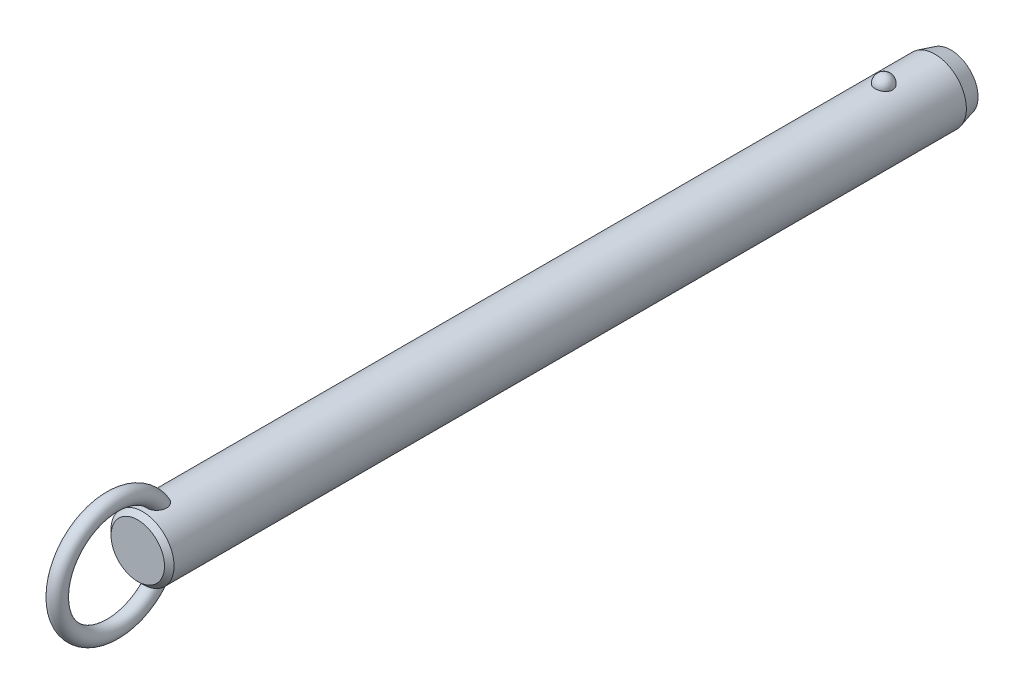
ISO-10303-21;
HEADER;
FILE_DESCRIPTION(('STEP AP214'),'2;1');
FILE_NAME('part.step','',(''),(''),'','','');
FILE_SCHEMA(('AUTOMOTIVE_DESIGN { 1 0 10303 214 1 1 1 1 }'));
ENDSEC;
DATA;
#1=APPLICATION_CONTEXT('core data for automotive mechanical design processes');
#2=APPLICATION_PROTOCOL_DEFINITION('international standard','automotive_design',2000,#1);
#3=PRODUCT_CONTEXT('',#1,'mechanical');
#4=PRODUCT('Part','Part','',(#3));
#5=PRODUCT_RELATED_PRODUCT_CATEGORY('part','',(#4));
#6=PRODUCT_DEFINITION_FORMATION('','',#4);
#7=PRODUCT_DEFINITION_CONTEXT('part definition',#1,'design');
#8=PRODUCT_DEFINITION('design','',#6,#7);
#9=PRODUCT_DEFINITION_SHAPE('','',#8);
#10=(LENGTH_UNIT() NAMED_UNIT(*) SI_UNIT(.MILLI.,.METRE.));
#11=(NAMED_UNIT(*) PLANE_ANGLE_UNIT() SI_UNIT($,.RADIAN.));
#12=(NAMED_UNIT(*) SI_UNIT($,.STERADIAN.) SOLID_ANGLE_UNIT());
#13=UNCERTAINTY_MEASURE_WITH_UNIT(LENGTH_MEASURE(1.E-05),#10,'distance_accuracy_value','');
#14=(GEOMETRIC_REPRESENTATION_CONTEXT(3) GLOBAL_UNCERTAINTY_ASSIGNED_CONTEXT((#13)) GLOBAL_UNIT_ASSIGNED_CONTEXT((#10,
#11,#12)) REPRESENTATION_CONTEXT('',''));
#15=CARTESIAN_POINT('',(0.,0.,0.));
#16=DIRECTION('',(0.,0.,1.));
#17=DIRECTION('',(1.,0.,0.));
#18=AXIS2_PLACEMENT_3D('',#15,#16,#17);
#19=CARTESIAN_POINT('',(0.,0.,175.3));
#20=DIRECTION('',(0.,0.,-1.));
#21=DIRECTION('',(-1.,0.,0.));
#22=AXIS2_PLACEMENT_3D('',#19,#20,#21);
#23=CYLINDRICAL_SURFACE('',#22,7.9);
#24=CARTESIAN_POINT('',(2.1785689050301,7.59367088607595,-2.20000000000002));
#25=CARTESIAN_POINT('',(2.17856679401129,7.59367269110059,-2.07701843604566));
#26=CARTESIAN_POINT('',(2.16853481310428,7.59657145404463,-1.95401006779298));
#27=CARTESIAN_POINT('',(2.12864689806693,7.607843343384,-1.71147811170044));
#28=CARTESIAN_POINT('',(2.09878338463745,7.61621856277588,-1.5919558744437));
#29=CARTESIAN_POINT('',(2.0199931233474,7.63749180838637,-1.35985638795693));
#30=CARTESIAN_POINT('',(1.97107475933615,7.6503878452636,-1.24727610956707));
#31=CARTESIAN_POINT('',(1.85539377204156,7.67926115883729,-1.03213234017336));
#32=CARTESIAN_POINT('',(1.78863158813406,7.69523835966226,-0.929568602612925));
#33=CARTESIAN_POINT('',(1.63856494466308,7.7285848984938,-0.73678633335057));
#34=CARTESIAN_POINT('',(1.55518140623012,7.7459606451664,-0.646630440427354));
#35=CARTESIAN_POINT('',(1.37422937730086,7.78009978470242,-0.481747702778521));
#36=CARTESIAN_POINT('',(1.27666086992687,7.79686317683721,-0.407020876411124));
#37=CARTESIAN_POINT('',(1.07024728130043,7.82786153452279,-0.275278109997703));
#38=CARTESIAN_POINT('',(0.961434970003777,7.84210353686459,-0.218212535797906));
#39=CARTESIAN_POINT('',(0.735351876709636,7.86652194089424,-0.123146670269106));
#40=CARTESIAN_POINT('',(0.618082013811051,7.87669878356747,-0.0851443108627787));
#41=CARTESIAN_POINT('',(0.380637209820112,7.89170521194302,-0.0298158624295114));
#42=CARTESIAN_POINT('',(0.260550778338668,7.89662650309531,-0.0121347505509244));
#43=CARTESIAN_POINT('',(0.0190117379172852,7.90090003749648,0.00324379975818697));
#44=CARTESIAN_POINT('',(-0.102440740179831,7.90025280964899,0.000943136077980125));
#45=CARTESIAN_POINT('',(-0.341452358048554,7.89351056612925,-0.0233955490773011));
#46=CARTESIAN_POINT('',(-0.459042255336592,7.88749257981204,-0.0451545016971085));
#47=CARTESIAN_POINT('',(-0.688796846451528,7.87075812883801,-0.107408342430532));
#48=CARTESIAN_POINT('',(-0.800961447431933,7.86004158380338,-0.14790355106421));
#49=CARTESIAN_POINT('',(-1.01743634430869,7.83497131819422,-0.246799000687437));
#50=CARTESIAN_POINT('',(-1.12169791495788,7.82059709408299,-0.305300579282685));
#51=CARTESIAN_POINT('',(-1.31891765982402,7.78976470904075,-0.43854939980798));
#52=CARTESIAN_POINT('',(-1.41187469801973,7.77330633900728,-0.513298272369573));
#53=CARTESIAN_POINT('',(-1.58577142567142,7.73972434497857,-0.678622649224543));
#54=CARTESIAN_POINT('',(-1.66645140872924,7.72259402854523,-0.769470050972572));
#55=CARTESIAN_POINT('',(-1.81161503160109,7.68983776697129,-0.963538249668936));
#56=CARTESIAN_POINT('',(-1.87609753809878,7.6742119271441,-1.0667599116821));
#57=CARTESIAN_POINT('',(-1.98790138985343,7.6460202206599,-1.28401170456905));
#58=CARTESIAN_POINT('',(-2.03501994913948,7.63349104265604,-1.39815107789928));
#59=CARTESIAN_POINT('',(-2.10986724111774,7.6131449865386,-1.6330178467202));
#60=CARTESIAN_POINT('',(-2.1375965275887,7.60532797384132,-1.75374505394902));
#61=CARTESIAN_POINT('',(-2.17289256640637,7.5953195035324,-1.99782562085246));
#62=CARTESIAN_POINT('',(-2.18054294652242,7.59310471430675,-2.12116592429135));
#63=CARTESIAN_POINT('',(-2.17572919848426,7.59448538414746,-2.36741799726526));
#64=CARTESIAN_POINT('',(-2.1632656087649,7.59808068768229,-2.49032977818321));
#65=CARTESIAN_POINT('',(-2.11865035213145,7.61064035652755,-2.73161015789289));
#66=CARTESIAN_POINT('',(-2.08659579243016,7.61957823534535,-2.84999812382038));
#67=CARTESIAN_POINT('',(-2.00367799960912,7.64179982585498,-3.07955956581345));
#68=CARTESIAN_POINT('',(-1.9528140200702,7.65508371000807,-3.19073275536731));
#69=CARTESIAN_POINT('',(-1.83321113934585,7.68460381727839,-3.40337899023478));
#70=CARTESIAN_POINT('',(-1.76437735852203,7.70085556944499,-3.5047965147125));
#71=CARTESIAN_POINT('',(-1.61069526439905,7.73445734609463,-3.69446912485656));
#72=CARTESIAN_POINT('',(-1.52584634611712,7.75180741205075,-3.78272371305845));
#73=CARTESIAN_POINT('',(-1.34198059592,7.78574608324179,-3.94393987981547));
#74=CARTESIAN_POINT('',(-1.24291308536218,7.80233167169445,-4.01684434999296));
#75=CARTESIAN_POINT('',(-1.03352039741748,7.83281625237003,-4.14489386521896));
#76=CARTESIAN_POINT('',(-0.92319600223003,7.84671543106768,-4.20004014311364));
#77=CARTESIAN_POINT('',(-0.695822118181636,7.87011575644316,-4.29042017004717));
#78=CARTESIAN_POINT('',(-0.578872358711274,7.87966903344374,-4.32589112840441));
#79=CARTESIAN_POINT('',(-0.340410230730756,7.8935652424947,-4.37692226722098));
#80=CARTESIAN_POINT('',(-0.218898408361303,7.89790879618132,-4.39248482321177));
#81=CARTESIAN_POINT('',(0.0228107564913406,7.90087453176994,-4.40314405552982));
#82=CARTESIAN_POINT('',(0.142990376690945,7.89960185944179,-4.39861683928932));
#83=CARTESIAN_POINT('',(0.380829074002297,7.89171262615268,-4.37008293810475));
#84=CARTESIAN_POINT('',(0.498488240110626,7.8850962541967,-4.34607694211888));
#85=CARTESIAN_POINT('',(0.727535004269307,7.86726442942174,-4.27939317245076));
#86=CARTESIAN_POINT('',(0.838944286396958,7.85606616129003,-4.23678512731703));
#87=CARTESIAN_POINT('',(1.05295421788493,7.83025654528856,-4.13408348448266));
#88=CARTESIAN_POINT('',(1.15555431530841,7.81564498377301,-4.07398879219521));
#89=CARTESIAN_POINT('',(1.35076763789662,7.7843022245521,-3.93687432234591));
#90=CARTESIAN_POINT('',(1.4432046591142,7.76754209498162,-3.85961036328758));
#91=CARTESIAN_POINT('',(1.6139111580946,7.73387857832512,-3.69076949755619));
#92=CARTESIAN_POINT('',(1.6921781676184,7.71697516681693,-3.59919010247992));
#93=CARTESIAN_POINT('',(1.83380875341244,7.6845643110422,-3.40247278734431));
#94=CARTESIAN_POINT('',(1.89689280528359,7.66908588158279,-3.29712873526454));
#95=CARTESIAN_POINT('',(2.0047823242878,7.64159441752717,-3.07707931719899));
#96=CARTESIAN_POINT('',(2.0495945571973,7.62958010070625,-2.96237743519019));
#97=CARTESIAN_POINT('',(2.11580183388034,7.61146617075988,-2.74040519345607));
#98=CARTESIAN_POINT('',(2.13929812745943,7.60484503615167,-2.63379846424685));
#99=CARTESIAN_POINT('',(2.17068242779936,7.59594664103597,-2.4181348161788));
#100=CARTESIAN_POINT('',(2.17857077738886,7.59366928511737,-2.30907795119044));
#101=CARTESIAN_POINT('',(2.1785689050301,7.59367088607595,-2.20000000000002));
#102=B_SPLINE_CURVE_WITH_KNOTS('',3,(#24,#25,#26,#27,#28,#29,#30,#31,#32,#33,#34,#35,#36,#37,
#38,#39,#40,#41,#42,#43,#44,#45,#46,#47,#48,#49,#50,#51,#52,#53,#54,#55,#56,#57,#58,#59,#60,#61,
#62,#63,#64,#65,#66,#67,#68,#69,#70,#71,#72,#73,#74,#75,#76,#77,#78,#79,#80,#81,#82,#83,#84,#85,
#86,#87,#88,#89,#90,#91,#92,#93,#94,#95,#96,#97,#98,#99,#100,#101),.UNSPECIFIED.,.T.,.F.,(4,2,2,
2,2,2,2,2,2,2,2,2,2,2,2,2,2,2,2,2,2,2,2,2,2,2,2,2,2,2,2,2,2,2,2,2,2,2,4),(0.,0.368552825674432,
0.737246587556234,1.10577831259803,1.4743009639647,1.8446206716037,2.21494081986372,
2.5842105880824,2.95344028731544,3.31611630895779,3.67875788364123,4.03628044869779,
4.39380913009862,4.75338791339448,5.11300280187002,5.47939989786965,5.8458226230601,
6.21639834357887,6.58696347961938,6.95598276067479,7.32499216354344,7.69218715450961,
8.0593967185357,8.42858578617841,8.79778880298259,9.16834203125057,9.5388695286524,
9.90482699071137,10.2707407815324,10.6298333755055,10.9889132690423,11.3466585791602,
11.7044262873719,12.0676511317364,12.4309391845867,12.8004764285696,13.1698767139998,
13.4967701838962,13.8236564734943),.UNSPECIFIED.);
#103=CARTESIAN_POINT('',(2.1785689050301,7.59367088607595,-2.20000000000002));
#104=VERTEX_POINT('',#103);
#105=EDGE_CURVE('E41',#104,#104,#102,.T.);
#106=ORIENTED_EDGE('',*,*,#105,.T.);
#107=EDGE_LOOP('',(#106));
#108=FACE_BOUND('',#107,.T.);
#109=CARTESIAN_POINT('',(0.,0.,183.62));
#110=DIRECTION('',(0.,0.,1.));
#111=DIRECTION('',(1.,0.,0.));
#112=AXIS2_PLACEMENT_3D('',#109,#110,#111);
#113=CIRCLE('',#112,7.9);
#114=CARTESIAN_POINT('',(7.9,0.,183.62));
#115=VERTEX_POINT('',#114);
#116=EDGE_CURVE('E10',#115,#115,#113,.F.);
#117=ORIENTED_EDGE('',*,*,#116,.T.);
#118=EDGE_LOOP('',(#117));
#119=FACE_BOUND('',#118,.T.);
#120=CARTESIAN_POINT('',(-0.630969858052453,-7.87476203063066,177.512432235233));
#121=CARTESIAN_POINT('',(-0.734180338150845,-7.86648998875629,177.547285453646));
#122=CARTESIAN_POINT('',(-0.834476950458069,-7.85639291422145,177.590816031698));
#123=CARTESIAN_POINT('',(-1.0262035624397,-7.83366343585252,177.694094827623));
#124=CARTESIAN_POINT('',(-1.1176141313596,-7.82102565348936,177.753877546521));
#125=CARTESIAN_POINT('',(-1.28877277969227,-7.79464922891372,177.887839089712));
#126=CARTESIAN_POINT('',(-1.36854014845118,-7.78091246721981,177.961993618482));
#127=CARTESIAN_POINT('',(-1.5146152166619,-7.75380398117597,178.122494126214));
#128=CARTESIAN_POINT('',(-1.58092966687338,-7.74043207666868,178.208833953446));
#129=CARTESIAN_POINT('',(-1.70019064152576,-7.7151252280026,178.392978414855));
#130=CARTESIAN_POINT('',(-1.75284037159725,-7.70322473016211,178.490979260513));
#131=CARTESIAN_POINT('',(-1.84263464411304,-7.68224112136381,178.694102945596));
#132=CARTESIAN_POINT('',(-1.87977299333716,-7.6731591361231,178.799228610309));
#133=CARTESIAN_POINT('',(-1.94152728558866,-7.65777930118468,179.023284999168));
#134=CARTESIAN_POINT('',(-1.96475471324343,-7.65179654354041,179.142616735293));
#135=CARTESIAN_POINT('',(-1.99449499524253,-7.64409642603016,179.38342986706));
#136=CARTESIAN_POINT('',(-2.0010005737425,-7.64238092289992,179.504912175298));
#137=CARTESIAN_POINT('',(-1.99856014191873,-7.64302120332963,179.768340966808));
#138=CARTESIAN_POINT('',(-1.98680021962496,-7.64611845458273,179.91025654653));
#139=CARTESIAN_POINT('',(-1.94457772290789,-7.65696186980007,180.191118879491));
#140=CARTESIAN_POINT('',(-1.91409393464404,-7.66471330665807,180.330062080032));
#141=CARTESIAN_POINT('',(-1.82768670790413,-7.68582947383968,180.631939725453));
#142=CARTESIAN_POINT('',(-1.76772963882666,-7.70003779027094,180.793686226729));
#143=CARTESIAN_POINT('',(-1.65998501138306,-7.72371550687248,181.027695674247));
#144=CARTESIAN_POINT('',(-1.62107967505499,-7.73200670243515,181.104297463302));
#145=CARTESIAN_POINT('',(-1.53727726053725,-7.7491037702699,181.254079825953));
#146=CARTESIAN_POINT('',(-1.49238215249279,-7.75790947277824,181.327261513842));
#147=CARTESIAN_POINT('',(-1.37397050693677,-7.77993338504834,181.50288382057));
#148=CARTESIAN_POINT('',(-1.29690364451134,-7.79328473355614,181.602955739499));
#149=CARTESIAN_POINT('',(-1.12885487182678,-7.81939266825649,181.790714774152));
#150=CARTESIAN_POINT('',(-1.03789926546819,-7.83215032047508,181.878424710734));
#151=CARTESIAN_POINT('',(-0.869532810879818,-7.85231710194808,182.013414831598));
#152=CARTESIAN_POINT('',(-0.795716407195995,-7.86021093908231,182.065076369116));
#153=CARTESIAN_POINT('',(-0.640813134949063,-7.87434920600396,182.156381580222));
#154=CARTESIAN_POINT('',(-0.559737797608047,-7.88059619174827,182.19604389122));
#155=CARTESIAN_POINT('',(-0.406456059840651,-7.88984116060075,182.254300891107));
#156=CARTESIAN_POINT('',(-0.335227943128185,-7.89321892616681,182.275384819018));
#157=CARTESIAN_POINT('',(-0.190193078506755,-7.89804235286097,182.30541418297));
#158=CARTESIAN_POINT('',(-0.116388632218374,-7.89948969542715,182.314370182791));
#159=CARTESIAN_POINT('',(0.0318414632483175,-7.90028409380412,182.319291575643));
#160=CARTESIAN_POINT('',(0.106268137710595,-7.89962640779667,182.315227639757));
#161=CARTESIAN_POINT('',(0.253290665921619,-7.8962818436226,182.294461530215));
#162=CARTESIAN_POINT('',(0.325885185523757,-7.8935935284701,182.277750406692));
#163=CARTESIAN_POINT('',(0.481441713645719,-7.88577340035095,182.228738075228));
#164=CARTESIAN_POINT('',(0.563611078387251,-7.88026321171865,182.194005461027));
#165=CARTESIAN_POINT('',(0.721129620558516,-7.86741729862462,182.111796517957));
#166=CARTESIAN_POINT('',(0.79646633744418,-7.86007832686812,182.064297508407));
#167=CARTESIAN_POINT('',(0.971456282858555,-7.84073285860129,181.936513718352));
#168=CARTESIAN_POINT('',(1.06719686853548,-7.82809461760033,181.851004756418));
#169=CARTESIAN_POINT('',(1.24418921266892,-7.80192439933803,181.666232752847));
#170=CARTESIAN_POINT('',(1.32540832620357,-7.78839049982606,181.566939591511));
#171=CARTESIAN_POINT('',(1.45199971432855,-7.76559693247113,181.389576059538));
#172=CARTESIAN_POINT('',(1.50085649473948,-7.75626094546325,181.313954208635));
#173=CARTESIAN_POINT('',(1.59197749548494,-7.73807279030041,181.158742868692));
#174=CARTESIAN_POINT('',(1.63423919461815,-7.72922080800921,181.079151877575));
#175=CARTESIAN_POINT('',(1.71222612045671,-7.71231959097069,180.916664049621));
#176=CARTESIAN_POINT('',(1.74794516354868,-7.70427111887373,180.833764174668));
#177=CARTESIAN_POINT('',(1.81270113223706,-7.68929240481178,180.665296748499));
#178=CARTESIAN_POINT('',(1.84173789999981,-7.68236218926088,180.579729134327));
#179=CARTESIAN_POINT('',(1.89322698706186,-7.6698375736,180.40528702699));
#180=CARTESIAN_POINT('',(1.91558744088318,-7.66426199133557,180.316383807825));
#181=CARTESIAN_POINT('',(1.95281367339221,-7.65485915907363,180.136969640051));
#182=CARTESIAN_POINT('',(1.96767946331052,-7.65103190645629,180.046458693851));
#183=CARTESIAN_POINT('',(2.0002145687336,-7.64262981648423,179.773732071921));
#184=CARTESIAN_POINT('',(2.00600691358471,-7.6410871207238,179.589709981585));
#185=CARTESIAN_POINT('',(1.98445334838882,-7.64669564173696,179.276501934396));
#186=CARTESIAN_POINT('',(1.96607186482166,-7.65149688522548,179.146618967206));
#187=CARTESIAN_POINT('',(1.90884967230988,-7.66597624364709,178.891632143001));
#188=CARTESIAN_POINT('',(1.87002101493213,-7.67565148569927,178.766525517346));
#189=CARTESIAN_POINT('',(1.77063986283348,-7.69918471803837,178.52454013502));
#190=CARTESIAN_POINT('',(1.70993724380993,-7.71307150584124,178.407725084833));
#191=CARTESIAN_POINT('',(1.56733070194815,-7.74330306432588,178.188144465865));
#192=CARTESIAN_POINT('',(1.48543692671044,-7.75964665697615,178.085372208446));
#193=CARTESIAN_POINT('',(1.31346177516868,-7.79047523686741,177.909380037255));
#194=CARTESIAN_POINT('',(1.22547278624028,-7.80495298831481,177.834106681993));
#195=CARTESIAN_POINT('',(1.03724352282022,-7.83218597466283,177.700486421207));
#196=CARTESIAN_POINT('',(0.93700840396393,-7.84494192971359,177.642132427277));
#197=CARTESIAN_POINT('',(0.733599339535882,-7.86649045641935,177.547027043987));
#198=CARTESIAN_POINT('',(0.630941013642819,-7.87547134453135,177.509210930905));
#199=CARTESIAN_POINT('',(0.420465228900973,-7.88950708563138,177.451116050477));
#200=CARTESIAN_POINT('',(0.31264590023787,-7.89456050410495,177.43084369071));
#201=CARTESIAN_POINT('',(0.0960869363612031,-7.9001518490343,177.408455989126));
#202=CARTESIAN_POINT('',(-0.0126341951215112,-7.90073226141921,177.406169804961));
#203=CARTESIAN_POINT('',(-0.228766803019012,-7.89742350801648,177.419367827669));
#204=CARTESIAN_POINT('',(-0.336180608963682,-7.89354403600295,177.434813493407));
#205=CARTESIAN_POINT('',(-0.473410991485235,-7.88586871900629,177.466217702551));
#206=CARTESIAN_POINT('',(-0.50525779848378,-7.88388984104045,177.474354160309));
#207=CARTESIAN_POINT('',(-0.56848128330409,-7.87958326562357,177.492208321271));
#208=CARTESIAN_POINT('',(-0.59985795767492,-7.87725556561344,177.501926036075));
#209=CARTESIAN_POINT('',(-0.630969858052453,-7.87476203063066,177.512432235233));
#210=B_SPLINE_CURVE_WITH_KNOTS('',3,(#120,#121,#122,#123,#124,#125,#126,#127,#128,#129,#130,
#131,#132,#133,#134,#135,#136,#137,#138,#139,#140,#141,#142,#143,#144,#145,#146,#147,#148,#149,
#150,#151,#152,#153,#154,#155,#156,#157,#158,#159,#160,#161,#162,#163,#164,#165,#166,#167,#168,
#169,#170,#171,#172,#173,#174,#175,#176,#177,#178,#179,#180,#181,#182,#183,#184,#185,#186,#187,
#188,#189,#190,#191,#192,#193,#194,#195,#196,#197,#198,#199,#200,#201,#202,#203,#204,#205,#206,
#207,#208,#209),.UNSPECIFIED.,.T.,.F.,(4,2,2,2,2,2,2,2,2,2,2,2,2,2,2,2,2,2,2,2,2,2,2,2,2,2,2,2,
2,2,2,2,2,2,2,2,2,2,2,2,2,2,2,2,4),(0.,0.327622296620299,0.655945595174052,0.983718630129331,
1.31132677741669,1.6455465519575,1.97989964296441,2.34365728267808,2.70757317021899,
3.13333684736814,3.55958380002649,4.07655306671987,4.33527897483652,4.59391999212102,
4.97382437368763,5.353017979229,5.62348245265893,5.89352465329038,6.11565959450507,
6.33760092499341,6.56004255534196,6.78264174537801,7.04930844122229,7.31645206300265,
7.70130871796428,8.08701995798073,8.35824509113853,8.6295736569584,8.9011573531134,
9.17274746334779,9.44791855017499,9.72308922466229,10.2715298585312,10.6638393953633,
11.0559179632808,11.4507403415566,11.8453740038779,12.1936425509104,12.5417649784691,
12.8695063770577,13.1973674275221,13.5221104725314,13.8461490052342,13.9449071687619,
14.0436660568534),.UNSPECIFIED.);
#211=CARTESIAN_POINT('',(-0.630969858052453,-7.87476203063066,177.512432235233));
#212=VERTEX_POINT('',#211);
#213=EDGE_CURVE('E59',#212,#212,#210,.T.);
#214=ORIENTED_EDGE('',*,*,#213,.T.);
#215=EDGE_LOOP('',(#214));
#216=FACE_BOUND('',#215,.T.);
#217=CARTESIAN_POINT('',(-0.630969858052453,7.87476203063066,177.512432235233));
#218=CARTESIAN_POINT('',(-0.528918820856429,7.88293636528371,177.477979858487));
#219=CARTESIAN_POINT('',(-0.423745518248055,7.88934810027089,177.451915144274));
#220=CARTESIAN_POINT('',(-0.210236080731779,7.8979273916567,177.417282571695));
#221=CARTESIAN_POINT('',(-0.10189380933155,7.90008607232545,177.408751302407));
#222=CARTESIAN_POINT('',(0.114660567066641,7.89990877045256,177.409457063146));
#223=CARTESIAN_POINT('',(0.222872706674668,7.89757640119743,177.41867980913));
#224=CARTESIAN_POINT('',(0.436107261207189,7.88867538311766,177.454652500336));
#225=CARTESIAN_POINT('',(0.541131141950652,7.8821087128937,177.48139425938));
#226=CARTESIAN_POINT('',(0.745085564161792,7.86545130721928,177.551756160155));
#227=CARTESIAN_POINT('',(0.844015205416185,7.85536005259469,177.595378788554));
#228=CARTESIAN_POINT('',(1.03299167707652,7.83275153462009,177.698379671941));
#229=CARTESIAN_POINT('',(1.12303841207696,7.8202342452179,177.757758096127));
#230=CARTESIAN_POINT('',(1.29214734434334,7.79408219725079,177.890864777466));
#231=CARTESIAN_POINT('',(1.37116907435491,7.78044359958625,177.964643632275));
#232=CARTESIAN_POINT('',(1.51597677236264,7.75353170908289,178.124235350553));
#233=CARTESIAN_POINT('',(1.58176261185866,7.74025841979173,178.210048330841));
#234=CARTESIAN_POINT('',(1.70057386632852,7.71504069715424,178.393644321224));
#235=CARTESIAN_POINT('',(1.75320073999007,7.7031425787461,178.491690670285));
#236=CARTESIAN_POINT('',(1.8429376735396,7.68216822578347,178.694893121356));
#237=CARTESIAN_POINT('',(1.88004278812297,7.67309289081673,178.800051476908));
#238=CARTESIAN_POINT('',(1.9417232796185,7.6577294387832,179.024167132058));
#239=CARTESIAN_POINT('',(1.96491037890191,7.65175648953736,179.143524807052));
#240=CARTESIAN_POINT('',(1.9945689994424,7.64407702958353,179.384384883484));
#241=CARTESIAN_POINT('',(2.00103304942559,7.64237242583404,179.50588821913));
#242=CARTESIAN_POINT('',(1.99850166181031,7.64303650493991,179.769368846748));
#243=CARTESIAN_POINT('',(1.98669038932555,7.64614714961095,179.911314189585));
#244=CARTESIAN_POINT('',(1.94436120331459,7.6570170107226,180.192228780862));
#245=CARTESIAN_POINT('',(1.91382203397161,7.66478150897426,180.331194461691));
#246=CARTESIAN_POINT('',(1.82728754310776,7.68592483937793,180.633111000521));
#247=CARTESIAN_POINT('',(1.76725778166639,7.7001468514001,180.794872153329));
#248=CARTESIAN_POINT('',(1.65939700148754,7.72384204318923,181.028891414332));
#249=CARTESIAN_POINT('',(1.62045187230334,7.73213852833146,181.105494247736));
#250=CARTESIAN_POINT('',(1.53656684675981,7.74924489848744,181.255273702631));
#251=CARTESIAN_POINT('',(1.49162892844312,7.75805461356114,181.328451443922));
#252=CARTESIAN_POINT('',(1.37317698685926,7.78007342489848,181.503952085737));
#253=CARTESIAN_POINT('',(1.29612360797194,7.79341423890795,181.603911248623));
#254=CARTESIAN_POINT('',(1.12812043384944,7.81949839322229,181.79145083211));
#255=CARTESIAN_POINT('',(1.03719688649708,7.83224280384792,181.879054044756));
#256=CARTESIAN_POINT('',(0.868871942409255,7.85239026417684,182.01389715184));
#257=CARTESIAN_POINT('',(0.795056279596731,7.86027769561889,182.065511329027));
#258=CARTESIAN_POINT('',(0.640160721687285,7.87440222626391,182.156720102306));
#259=CARTESIAN_POINT('',(0.559092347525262,7.88064188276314,182.196333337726));
#260=CARTESIAN_POINT('',(0.405820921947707,7.8898738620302,182.254505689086));
#261=CARTESIAN_POINT('',(0.334594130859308,7.89324577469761,182.275552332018));
#262=CARTESIAN_POINT('',(0.189568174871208,7.89805733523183,182.305507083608));
#263=CARTESIAN_POINT('',(0.115771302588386,7.89949866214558,182.314425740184));
#264=CARTESIAN_POINT('',(-0.0324359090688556,7.90028156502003,182.31927589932));
#265=CARTESIAN_POINT('',(-0.106847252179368,7.89961843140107,182.315178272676));
#266=CARTESIAN_POINT('',(-0.253834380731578,7.8962642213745,182.294351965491));
#267=CARTESIAN_POINT('',(-0.326408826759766,7.89357170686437,182.277614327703));
#268=CARTESIAN_POINT('',(-0.481962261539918,7.88574179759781,182.228539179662));
#269=CARTESIAN_POINT('',(-0.564145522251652,7.88022507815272,182.193763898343));
#270=CARTESIAN_POINT('',(-0.721685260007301,7.86736646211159,182.111468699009));
#271=CARTESIAN_POINT('',(-0.797029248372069,7.8600213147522,182.063926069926));
#272=CARTESIAN_POINT('',(-0.972044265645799,7.84066026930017,181.936026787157));
#273=CARTESIAN_POINT('',(-1.06779803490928,7.82801274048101,181.850443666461));
#274=CARTESIAN_POINT('',(-1.2448053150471,7.80182621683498,181.665522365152));
#275=CARTESIAN_POINT('',(-1.32602618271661,7.78828530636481,181.566154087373));
#276=CARTESIAN_POINT('',(-1.45259834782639,7.76548487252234,181.388680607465));
#277=CARTESIAN_POINT('',(-1.50143856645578,7.75614818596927,181.313025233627));
#278=CARTESIAN_POINT('',(-1.59252410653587,7.73796020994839,181.157748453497));
#279=CARTESIAN_POINT('',(-1.63476690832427,7.72910910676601,181.078125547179));
#280=CARTESIAN_POINT('',(-1.71271318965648,7.71221133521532,180.915575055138));
#281=CARTESIAN_POINT('',(-1.74841047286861,7.70416543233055,180.832644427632));
#282=CARTESIAN_POINT('',(-1.81311929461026,7.6891937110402,180.664116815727));
#283=CARTESIAN_POINT('',(-1.84213067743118,7.68226791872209,180.578519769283));
#284=CARTESIAN_POINT('',(-1.89356259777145,7.66975461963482,180.404025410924));
#285=CARTESIAN_POINT('',(-1.91589165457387,7.66418586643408,180.315099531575));
#286=CARTESIAN_POINT('',(-1.9530507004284,7.65479859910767,180.135642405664));
#287=CARTESIAN_POINT('',(-1.96788069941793,7.65098008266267,180.045111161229));
#288=CARTESIAN_POINT('',(-2.00030078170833,7.64260704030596,179.772327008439));
#289=CARTESIAN_POINT('',(-2.00600576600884,7.64108760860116,179.588271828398));
#290=CARTESIAN_POINT('',(-1.9842848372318,7.64673945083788,179.275080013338));
#291=CARTESIAN_POINT('',(-1.96583698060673,7.65155751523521,179.145240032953));
#292=CARTESIAN_POINT('',(-1.90848948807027,7.66606613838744,178.890361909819));
#293=CARTESIAN_POINT('',(-1.86960376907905,7.67575338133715,178.765320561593));
#294=CARTESIAN_POINT('',(-1.77013421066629,7.6993013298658,178.523500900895));
#295=CARTESIAN_POINT('',(-1.70940488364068,7.71318991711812,178.406784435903));
#296=CARTESIAN_POINT('',(-1.56672953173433,7.74342495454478,178.187340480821));
#297=CARTESIAN_POINT('',(-1.48478316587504,7.75977144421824,178.08461321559));
#298=CARTESIAN_POINT('',(-1.31266325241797,7.79061163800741,177.908643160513));
#299=CARTESIAN_POINT('',(-1.22456383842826,7.80509908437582,177.833358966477));
#300=CARTESIAN_POINT('',(-1.03622400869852,7.83231881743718,177.699865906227));
#301=CARTESIAN_POINT('',(-0.936015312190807,7.84505551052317,177.641613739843));
#302=CARTESIAN_POINT('',(-0.798824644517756,7.85957802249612,177.577540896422));
#303=CARTESIAN_POINT('',(-0.765787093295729,7.86286821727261,177.563224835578));
#304=CARTESIAN_POINT('',(-0.698939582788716,7.86909211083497,177.536436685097));
#305=CARTESIAN_POINT('',(-0.66512963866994,7.8720258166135,177.523964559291));
#306=CARTESIAN_POINT('',(-0.630969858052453,7.87476203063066,177.512432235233));
#307=B_SPLINE_CURVE_WITH_KNOTS('',3,(#217,#218,#219,#220,#221,#222,#223,#224,#225,#226,#227,
#228,#229,#230,#231,#232,#233,#234,#235,#236,#237,#238,#239,#240,#241,#242,#243,#244,#245,#246,
#247,#248,#249,#250,#251,#252,#253,#254,#255,#256,#257,#258,#259,#260,#261,#262,#263,#264,#265,
#266,#267,#268,#269,#270,#271,#272,#273,#274,#275,#276,#277,#278,#279,#280,#281,#282,#283,#284,
#285,#286,#287,#288,#289,#290,#291,#292,#293,#294,#295,#296,#297,#298,#299,#300,#301,#302,#303,
#304,#305,#306),.UNSPECIFIED.,.T.,.F.,(4,2,2,2,2,2,2,2,2,2,2,2,2,2,2,2,2,2,2,2,2,2,2,2,2,2,2,2,
2,2,2,2,2,2,2,2,2,2,2,2,2,2,2,2,4),(0.,0.323920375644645,0.648516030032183,0.972850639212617,
1.29703380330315,1.62126473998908,1.94549915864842,2.27089401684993,2.5962920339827,
2.93059633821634,3.26500707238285,3.6288164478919,3.99278833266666,4.4186542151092,
4.84500434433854,5.36209210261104,5.62087589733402,5.87957448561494,6.25918598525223,
6.63808782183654,6.90846748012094,7.17842501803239,7.40052350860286,7.6224287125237,
7.84483086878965,8.06739077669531,8.33414615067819,8.60137921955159,8.98641454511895,
9.37230415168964,9.64358673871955,9.91497268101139,10.1866142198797,10.4582620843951,
10.7334745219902,11.008686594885,11.5572126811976,11.9494246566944,12.3413699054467,
12.7359755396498,13.1305875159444,13.4791770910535,13.82687259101,13.9353013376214,
14.0437279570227),.UNSPECIFIED.);
#308=CARTESIAN_POINT('',(-0.630969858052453,7.87476203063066,177.512432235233));
#309=VERTEX_POINT('',#308);
#310=EDGE_CURVE('E67',#309,#309,#307,.T.);
#311=ORIENTED_EDGE('',*,*,#310,.T.);
#312=EDGE_LOOP('',(#311));
#313=FACE_BOUND('',#312,.T.);
#314=CARTESIAN_POINT('',(0.,0.,-15.));
#315=DIRECTION('',(0.,0.,-1.));
#316=DIRECTION('',(-1.,0.,0.));
#317=AXIS2_PLACEMENT_3D('',#314,#315,#316);
#318=CIRCLE('',#317,7.9);
#319=CARTESIAN_POINT('',(-7.9,0.,-15.));
#320=VERTEX_POINT('',#319);
#321=EDGE_CURVE('E56',#320,#320,#318,.F.);
#322=ORIENTED_EDGE('',*,*,#321,.T.);
#323=EDGE_LOOP('',(#322));
#324=FACE_BOUND('',#323,.T.);
#325=ADVANCED_FACE('F37',(#108,#119,#216,#313,#324),#23,.T.);
#326=CARTESIAN_POINT('',(0.,0.,-19.));
#327=DIRECTION('',(0.,0.,-1.));
#328=DIRECTION('',(-1.,0.,0.));
#329=AXIS2_PLACEMENT_3D('',#326,#327,#328);
#330=PLANE('',#329);
#331=CARTESIAN_POINT('',(0.,0.,-19.));
#332=DIRECTION('',(0.,0.,-1.));
#333=DIRECTION('',(-1.,0.,0.));
#334=AXIS2_PLACEMENT_3D('',#331,#332,#333);
#335=CIRCLE('',#334,6.82820323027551);
#336=CARTESIAN_POINT('',(-6.82820323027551,0.,-19.));
#337=VERTEX_POINT('',#336);
#338=EDGE_CURVE('E66',#337,#337,#335,.T.);
#339=ORIENTED_EDGE('',*,*,#338,.T.);
#340=EDGE_LOOP('',(#339));
#341=FACE_BOUND('',#340,.T.);
#342=ADVANCED_FACE('F85',(#341),#330,.T.);
#343=CARTESIAN_POINT('',(0.,0.,-19.));
#344=DIRECTION('',(0.,0.,1.));
#345=DIRECTION('',(1.,0.,0.));
#346=AXIS2_PLACEMENT_3D('',#343,#344,#345);
#347=CONICAL_SURFACE('',#346,6.82820323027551,0.261799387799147);
#348=ORIENTED_EDGE('',*,*,#321,.F.);
#349=EDGE_LOOP('',(#348));
#350=FACE_BOUND('',#349,.T.);
#351=ORIENTED_EDGE('',*,*,#338,.F.);
#352=EDGE_LOOP('',(#351));
#353=FACE_BOUND('',#352,.T.);
#354=ADVANCED_FACE('F83',(#350,#353),#347,.T.);
#355=CARTESIAN_POINT('',(0.,0.,184.82));
#356=DIRECTION('',(0.,0.,1.));
#357=DIRECTION('',(1.,0.,0.));
#358=AXIS2_PLACEMENT_3D('',#355,#356,#357);
#359=PLANE('',#358);
#360=CARTESIAN_POINT('',(0.,0.,184.82));
#361=DIRECTION('',(0.,0.,1.));
#362=DIRECTION('',(1.,0.,0.));
#363=AXIS2_PLACEMENT_3D('',#360,#361,#362);
#364=CIRCLE('',#363,6.70000000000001);
#365=CARTESIAN_POINT('',(6.70000000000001,0.,184.82));
#366=VERTEX_POINT('',#365);
#367=EDGE_CURVE('E50',#366,#366,#364,.T.);
#368=ORIENTED_EDGE('',*,*,#367,.T.);
#369=EDGE_LOOP('',(#368));
#370=FACE_BOUND('',#369,.T.);
#371=ADVANCED_FACE('F77',(#370),#359,.T.);
#372=CARTESIAN_POINT('',(0.,0.,191.15));
#373=DIRECTION('',(1.,0.,0.));
#374=DIRECTION('',(0.,0.,-1.));
#375=AXIS2_PLACEMENT_3D('',#372,#373,#374);
#376=TOROIDAL_SURFACE('',#375,13.85,2.);
#377=ORIENTED_EDGE('',*,*,#310,.F.);
#378=EDGE_LOOP('',(#377));
#379=FACE_BOUND('',#378,.T.);
#380=ORIENTED_EDGE('',*,*,#213,.F.);
#381=EDGE_LOOP('',(#380));
#382=FACE_BOUND('',#381,.T.);
#383=ADVANCED_FACE('F73',(#379,#382),#376,.T.);
#384=CARTESIAN_POINT('',(0.,0.,184.82));
#385=DIRECTION('',(0.,0.,-1.));
#386=DIRECTION('',(-1.,0.,0.));
#387=AXIS2_PLACEMENT_3D('',#384,#385,#386);
#388=CONICAL_SURFACE('',#387,6.70000000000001,0.785398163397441);
#389=ORIENTED_EDGE('',*,*,#116,.F.);
#390=EDGE_LOOP('',(#389));
#391=FACE_BOUND('',#390,.T.);
#392=ORIENTED_EDGE('',*,*,#367,.F.);
#393=EDGE_LOOP('',(#392));
#394=FACE_BOUND('',#393,.T.);
#395=ADVANCED_FACE('F39',(#391,#394),#388,.T.);
#396=CARTESIAN_POINT('',(0.,7.9,-2.20000000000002));
#397=DIRECTION('',(0.,1.,0.));
#398=DIRECTION('',(0.,0.,-1.));
#399=AXIS2_PLACEMENT_3D('',#396,#397,#398);
#400=SPHERICAL_SURFACE('',#399,2.2);
#401=ORIENTED_EDGE('',*,*,#105,.F.);
#402=EDGE_LOOP('',(#401));
#403=FACE_BOUND('',#402,.T.);
#404=ADVANCED_FACE('F79',(#403),#400,.T.);
#405=CLOSED_SHELL('',(#325,#342,#354,#371,#383,#395,#404));
#406=MANIFOLD_SOLID_BREP('B2',#405);
#407=ADVANCED_BREP_SHAPE_REPRESENTATION('',(#18,#406),#14);
#408=SHAPE_DEFINITION_REPRESENTATION(#9,#407);
ENDSEC;
END-ISO-10303-21;
